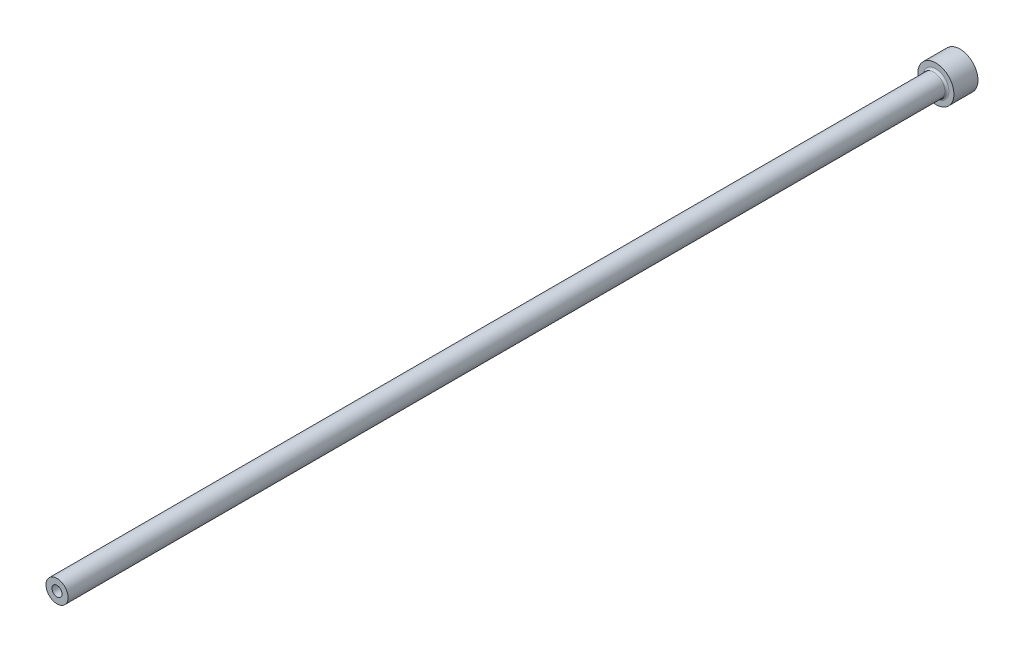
from build123d import *

# Parameters (mm, degrees)
HEAD_FILLET_R          = 0.5
ID_RELIEF_CHAMFER_SIZE = 0.5


with BuildPart() as part:
    # OD FV → Base Revolve (revolve)
    with BuildSketch(Plane(origin=(0, 0, 0), x_dir=(1, 0, 0), z_dir=(0, 1, 0))):
        Polygon((0, -225), (2.75, -225), (2.75, -6), (4.5, -6), (4.5, 0), (0, 0), align=None)
    revolve(axis=Axis((0, 0, 225), (0, 0, -1)))

    # ID FV → Hole (revolve, cut)
    with BuildSketch(Plane(origin=(0, 0, 0), x_dir=(1, 0, 0), z_dir=(0, 1, 0))):
        Polygon((0, -225), (1.25, -225), (1.25, -125), (1.5, -124.566987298), (1.5, 0), (0, 0), align=None)
    revolve(axis=Axis((0, 0, 225), (0, 0, -1)), mode=Mode.SUBTRACT)

    # Head Fillet
    head_fillet_edges = [part.edges().sort_by_distance(p)[0] for p in [
        (-2.75, 0, 6),
    ]]
    fillet(head_fillet_edges, radius=HEAD_FILLET_R)

    # ID Relief Chamfer
    id_relief_chamfer_edges = [part.edges().sort_by_distance(p)[0] for p in [
        (-1.5, 0, 0),
    ]]
    chamfer(id_relief_chamfer_edges, length=ID_RELIEF_CHAMFER_SIZE)


solid = part.part
